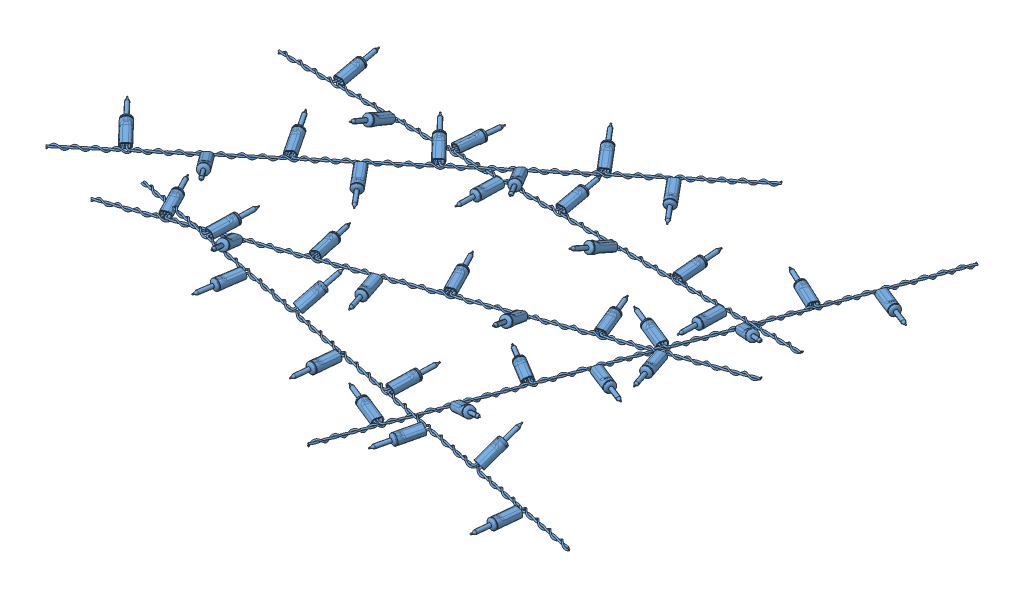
SolidWorks assembly Festive Lights.SLDASM, configuration Default (file format 14000). Lengths in mm.
Overall size (495.59 43.42 411.36).
5 component instances, 1 part files, 0 mates.
Components (placement in the parent):
- Festive Lights-1: Festive Lights.SLDPRT [Default] at (-219.46 90.2062 -57.0212) size (411.1 18.28 73.23)
- Festive Lights-2: Festive Lights.SLDPRT [Default] at (-192.0256 90.8561 118.1058) x (0.939693 0 -0.34202) z (0.34202 0 0.939693) size (411.1 18.28 73.23)
- Festive Lights-3: Festive Lights.SLDPRT [Default] at (-241.4838 95.0489 104.287) x (0.766044 0 -0.642788) z (0.633022 -0.173648 0.754407) size (411.1 18.28 73.23)
- Festive Lights-4: Festive Lights.SLDPRT [Default] at (55.4885 85.5585 194.8774) x (0.34202 0 -0.939693) z (0.939693 0 0.34202) size (411.1 18.28 73.23)
- Festive Lights-5: Festive Lights.SLDPRT [Default] at (225.9622 82.3129 160.2696) x (-0.984808 0.030154 -0.17101) z (0.173648 0.17101 -0.969846) size (411.1 18.28 73.23)
